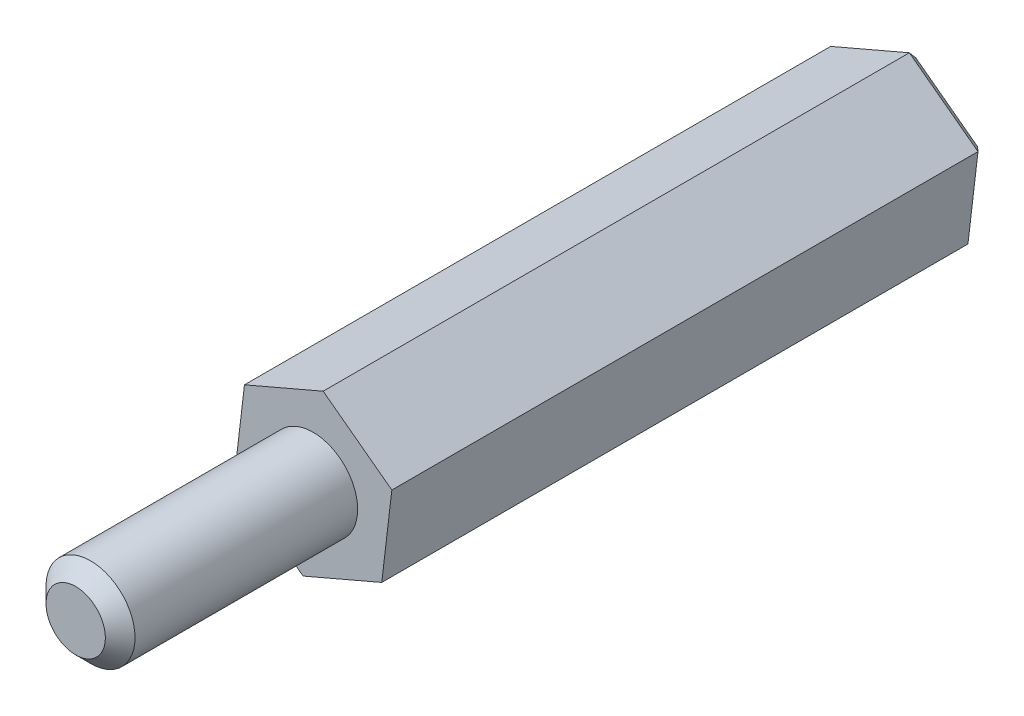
from build123d import *

# Parameters (mm, degrees)
BOSS_EXTRU_1_DEPTH      = 20
ESQUISSE2_R             = 1.5
BOSS_EXTRU_2_DEPTH      = 8
CHANFREIN1_SIZE         = 0.5
ESQUISSE3_R             = 1.5
ENL_V_MAT_EXTRU_1_DEPTH = 10
CHANFREIN2_SIZE         = 0.5
CHANFREIN3_SIZE         = 0.25


with BuildPart() as part:
    # Esquisse1 → Boss.-Extru.1 (new body)
    with BuildSketch(Plane.XY):
        Polygon((-2.652229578, -1.1397419), (-0.33906935, -2.866769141), (2.313160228, -1.727027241), (2.652229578, 1.1397419), (0.33906935, 2.866769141), (-2.313160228, 1.727027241), align=None)
    extrude(amount=BOSS_EXTRU_1_DEPTH)

    # Esquisse2 → Boss.-Extru.2 (add)
    with BuildSketch(Plane.XY.offset(20)):
        Circle(ESQUISSE2_R)
    extrude(amount=BOSS_EXTRU_2_DEPTH)

    # Chanfrein1
    chanfrein1_edges = [part.edges().sort_by_distance(p)[0] for p in [
        (-1.5, 0, 28),
    ]]
    chamfer(chanfrein1_edges, length=CHANFREIN1_SIZE)

    # Esquisse3 → Enl_v. mat.-Extru.1 (cut)
    with BuildSketch(Plane(origin=(0, 0, 0), x_dir=(-1, 0, 0), z_dir=(0, 0, -1))):
        with Locations(Location((0, 0, 0), (0, 0, 180))):
            Circle(ESQUISSE3_R)
    extrude(amount=-ENL_V_MAT_EXTRU_1_DEPTH, mode=Mode.SUBTRACT)

    # Chanfrein2
    chanfrein2_edges = [part.edges().sort_by_distance(p)[0] for p in [
        (-1.5, 0, 0),
    ]]
    chamfer(chanfrein2_edges, length=CHANFREIN2_SIZE)

    # Chanfrein3
    chanfrein3_edges = [part.edges().sort_by_distance(p)[0] for p in [
        (-0.987045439, 2.296898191, 0),
        (1.495649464, 2.003255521, 0),
        (2.482694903, -0.293642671, 0),
        (0.987045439, -2.296898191, 0),
        (-1.495649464, -2.003255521, 0),
        (-2.482694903, 0.293642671, 0),
    ]]
    chamfer(chanfrein3_edges, length=CHANFREIN3_SIZE)


solid = part.part
